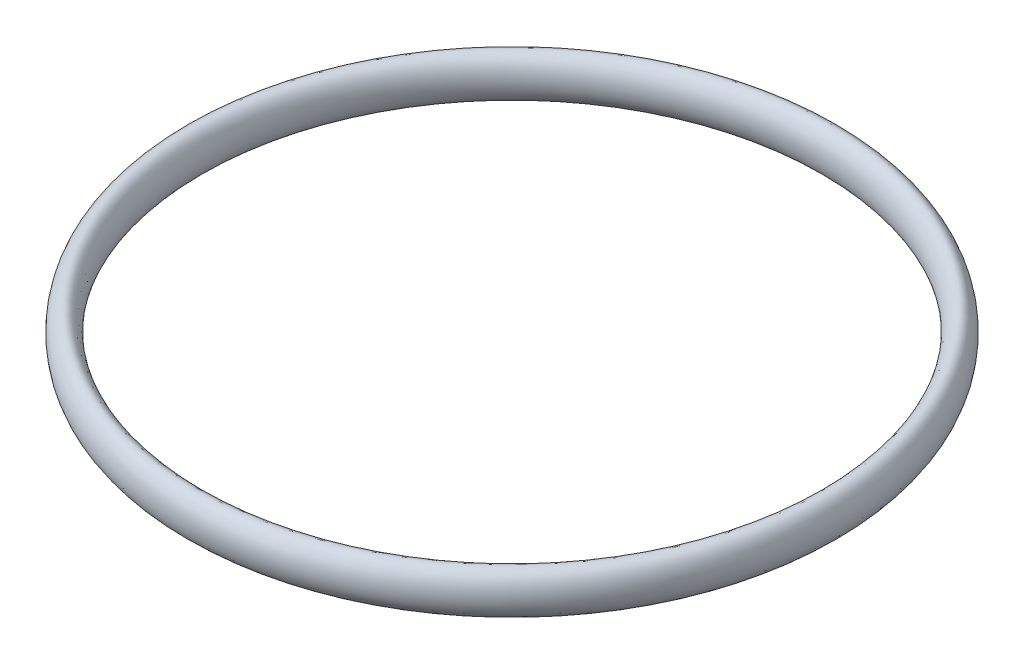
from build123d import *

# Parameters (mm, degrees)
ESQUISSE1_RX = 3.55
ESQUISSE1_RY = 2.175


with BuildPart() as part:
    # Esquisse1 → R_volution1 (revolve)
    with BuildSketch(Plane.XY):
        with Locations(Location((-52.825, -3.55), (0, 0, 90))):
            Ellipse(ESQUISSE1_RX, ESQUISSE1_RY)
    revolve(axis=Axis((0, 51.673755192, 0), (0, -1, 0)))


solid = part.part
